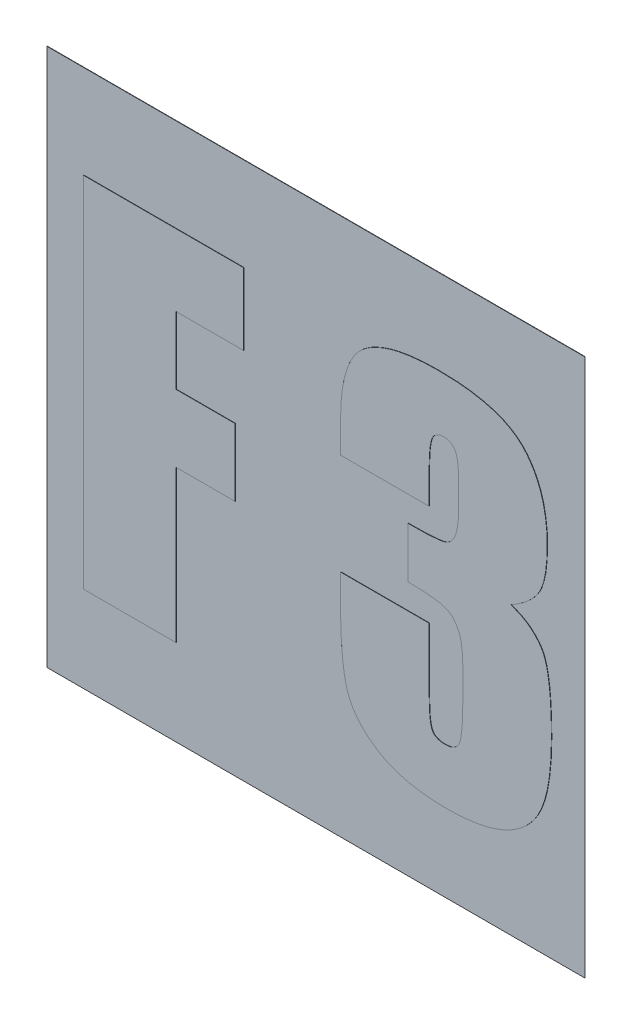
from build123d import *

# Parameters (mm, degrees)
SKETCH1_W           = 15
SKETCH1_H           = 15
BASE_EXTRUDE_DEPTH  = 0.01
BOSS_EXTRUDE1_DEPTH = 0.01


with BuildPart() as part:
    # Sketch1 → Base-Extrude (new body)
    with BuildSketch(Plane.XY):
        Rectangle(SKETCH1_W, SKETCH1_H)
    extrude(amount=BASE_EXTRUDE_DEPTH)

    # Sketch3 → Boss-Extrude1 (add)
    with BuildSketch(Plane.XY.offset(0.01)):
        Polygon((-6.472368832, 4.904808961), (-2.004055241, 4.904808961), (-2.004055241, 2.905826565), (-3.885450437, 2.905826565), (-3.885450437, 1.024431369), (-2.239229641, 1.024431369), (-2.239229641, -0.856963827), (-3.885450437, -0.856963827), (-3.885450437, -5.090103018), (-6.472368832, -5.090103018), align=None)
        with BuildLine():
            add(Edge.make_bspline(
                [(5.451708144, 0.49528897), (5.541704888, 0.46122907), (5.71609099, 0.395231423), (5.951267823, 0.254576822), (6.147281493, 0.079818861), (6.285825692, -0.092074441), (6.374221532, -0.261448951), (6.429491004, -0.425746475), (6.47634556, -0.625108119), (6.513333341, -0.861085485), (6.54456131, -1.13319291), (6.565545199, -1.441559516), (6.578417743, -1.785912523), (6.579330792, -2.027310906), (6.579810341, -2.154097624)],
                knots=[0, 0, 0, 0, 1.102876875, 2.137037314, 3.122829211, 4.104151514, 4.651126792, 5.306854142, 6.087576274, 6.999201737, 8.046202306, 9.229933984, 10.545112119, 12, 12, 12, 12], degree=3))
            add(Edge.make_bspline(
                [(6.579810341, -2.154097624), (6.579251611, -2.249649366), (6.578162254, -2.43594664), (6.565520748, -2.706880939), (6.542845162, -2.961695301), (6.514955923, -3.199828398), (6.475365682, -3.421508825), (6.4310113, -3.62688384), (6.375382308, -3.815865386), (6.311376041, -3.989219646), (6.237022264, -4.149908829), (6.151069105, -4.299319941), (6.050020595, -4.437378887), (5.940700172, -4.568709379), (5.816810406, -4.688656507), (5.679099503, -4.797101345), (5.531093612, -4.8981779), (5.370194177, -4.988868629), (5.196816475, -5.066913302), (5.012561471, -5.137635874), (4.815842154, -5.195751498), (4.60781307, -5.243417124), (4.388177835, -5.280292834), (4.156835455, -5.304852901), (3.913544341, -5.322479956), (3.747340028, -5.324329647), (3.662177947, -5.325277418)],
                knots=[0, 0, 0, 0, 1.369902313, 2.670899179, 3.88720887, 5.037313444, 6.107010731, 7.114651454, 8.048218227, 8.928962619, 9.761788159, 10.584085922, 11.395576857, 12.211804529, 13.031472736, 13.862491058, 14.72219323, 15.598945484, 16.506591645, 17.445921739, 18.426573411, 19.444718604, 20.504277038, 21.617454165, 22.779197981, 24, 24, 24, 24], degree=3))
            add(Edge.make_bspline(
                [(3.662177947, -5.325277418), (3.565978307, -5.324651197), (3.37886012, -5.323433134), (3.106134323, -5.30155964), (2.848949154, -5.271730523), (2.607716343, -5.227741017), (2.382277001, -5.171023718), (2.17313853, -5.100991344), (1.978289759, -5.021364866), (1.801922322, -4.924582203), (1.641206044, -4.819500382), (1.492410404, -4.711536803), (1.360037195, -4.595479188), (1.242042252, -4.47335357), (1.136273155, -4.347507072), (1.048139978, -4.21345763), (0.971968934, -4.075729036), (0.909481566, -3.928047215), (0.860011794, -3.763274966), (0.816012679, -3.57560507), (0.780160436, -3.360743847), (0.751608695, -3.119093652), (0.727605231, -2.851386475), (0.711525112, -2.556637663), (0.702857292, -2.23499193), (0.701274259, -2.011405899), (0.700450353, -1.895038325)],
                knots=[0, 0, 0, 0, 1.297206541, 2.523200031, 3.68822888, 4.788425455, 5.828288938, 6.820979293, 7.76145907, 8.663379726, 9.529520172, 10.350685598, 11.141021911, 11.900490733, 12.639834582, 13.354681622, 14.060787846, 14.760437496, 15.512955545, 16.378583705, 17.359134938, 18.449361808, 19.660232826, 20.984074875, 22.430331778, 24, 24, 24, 24], degree=3))
            Line((0.700450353, -1.895038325), (0.700450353, -1.092138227))
            Line((0.700450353, -1.092138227), (3.169781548, -1.092138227))
            Line((3.169781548, -1.092138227), (3.169781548, -2.765918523))
            add(Edge.make_bspline(
                [(3.169781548, -2.765918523), (3.17021198, -2.8192041), (3.171028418, -2.920275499), (3.175006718, -3.064808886), (3.179443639, -3.194167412), (3.189151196, -3.308058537), (3.199429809, -3.406909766), (3.213835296, -3.49033521), (3.230278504, -3.559125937), (3.252702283, -3.629681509), (3.299526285, -3.699935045), (3.383122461, -3.757103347), (3.489245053, -3.792340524), (3.568162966, -3.79513591), (3.610733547, -3.796643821)],
                knots=[0, 0, 0, 0, 1.493757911, 2.833340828, 4.053391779, 5.121294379, 6.037036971, 6.83864217, 7.492399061, 8.019055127, 8.909502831, 9.795636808, 10.810903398, 12, 12, 12, 12], degree=3))
            add(Edge.make_bspline(
                [(3.610733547, -3.796643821), (3.657620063, -3.794138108), (3.745079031, -3.789464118), (3.864542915, -3.747227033), (3.956695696, -3.672591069), (4.011087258, -3.586195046), (4.037803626, -3.496164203), (4.058275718, -3.405442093), (4.073156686, -3.291597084), (4.088363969, -3.155701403), (4.098765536, -2.996924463), (4.105963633, -2.815589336), (4.109019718, -2.611594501), (4.109976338, -2.468276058), (4.110479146, -2.392946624)],
                knots=[0, 0, 0, 0, 1.00518262, 1.875000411, 2.669993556, 3.509342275, 4.020974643, 4.681532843, 5.505591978, 6.484616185, 7.618559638, 8.921810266, 10.382076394, 12, 12, 12, 12], degree=3))
            Line((4.110479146, -2.392946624), (4.110479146, -1.691098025))
            add(Edge.make_bspline(
                [(4.110479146, -1.691098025), (4.109713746, -1.600362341), (4.108287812, -1.431322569), (4.08194848, -1.197917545), (4.044954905, -1.001849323), (3.985393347, -0.843187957), (3.909844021, -0.715148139), (3.819006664, -0.611594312), (3.710227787, -0.532893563), (3.6058627, -0.487905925), (3.510331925, -0.461725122), (3.422645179, -0.443464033), (3.319407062, -0.429706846), (3.201185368, -0.416713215), (3.067602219, -0.406017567), (2.918750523, -0.397065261), (2.755237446, -0.389185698), (2.641261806, -0.38749592), (2.581845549, -0.386615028)],
                knots=[0, 0, 0, 0, 1.795411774, 3.344836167, 4.645792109, 5.735849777, 6.682123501, 7.575395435, 8.44379141, 9.318010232, 9.809404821, 10.403985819, 11.089977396, 11.870716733, 12.758953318, 13.743088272, 14.823456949, 16, 16, 16, 16], degree=3))
            Line((2.581845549, -0.386615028), (2.581845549, 1.024431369))
            add(Edge.make_bspline(
                [(2.581845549, 1.024431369), (2.648600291, 1.025108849), (2.775373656, 1.026395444), (2.955465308, 1.02722335), (3.115410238, 1.032245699), (3.25494493, 1.042357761), (3.374484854, 1.05083456), (3.474597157, 1.061117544), (3.554479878, 1.075150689), (3.633822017, 1.096367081), (3.714735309, 1.136821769), (3.794334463, 1.206455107), (3.86083388, 1.295680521), (3.910135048, 1.408923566), (3.948380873, 1.548008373), (3.974310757, 1.718115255), (3.99035213, 1.920723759), (3.992004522, 2.066756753), (3.992891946, 2.145184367)],
                knots=[0, 0, 0, 0, 1.43856948, 2.731975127, 3.880825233, 4.885990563, 5.746351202, 6.463392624, 7.053595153, 7.492294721, 8.230047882, 8.978698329, 9.752066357, 10.608368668, 11.623534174, 12.853720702, 14.310277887, 16, 16, 16, 16], degree=3))
            Line((3.992891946, 2.145184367), (3.992891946, 2.722096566))
            add(Edge.make_bspline(
                [(3.992891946, 2.722096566), (3.992156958, 2.80480146), (3.990815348, 2.955766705), (3.974157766, 3.158867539), (3.944994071, 3.316687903), (3.902403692, 3.434210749), (3.840573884, 3.515071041), (3.769250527, 3.573837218), (3.680406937, 3.605166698), (3.617687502, 3.609231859), (3.585011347, 3.611349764)],
                knots=[0, 0, 0, 0, 1.803442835, 3.291911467, 4.43652086, 5.299582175, 5.986062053, 6.632668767, 7.287635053, 8, 8, 8, 8], degree=3))
            add(Edge.make_bspline(
                [(3.585011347, 3.611349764), (3.547813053, 3.610036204), (3.477965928, 3.607569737), (3.383466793, 3.567715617), (3.306078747, 3.507667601), (3.261348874, 3.435575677), (3.235519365, 3.364853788), (3.21734241, 3.297266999), (3.203718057, 3.215962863), (3.190130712, 3.121726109), (3.182222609, 3.013679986), (3.174137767, 2.892462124), (3.171289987, 2.757627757), (3.17030143, 2.663301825), (3.169781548, 2.613695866)],
                knots=[0, 0, 0, 0, 1.091565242, 2.049628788, 2.976927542, 3.946043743, 4.507512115, 5.201335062, 6.010901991, 6.942783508, 8.01465746, 9.211612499, 10.533588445, 12, 12, 12, 12], degree=3))
            Line((3.169781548, 2.613695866), (3.169781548, 1.729954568))
            Line((3.169781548, 1.729954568), (0.700450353, 1.729954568))
            Line((0.700450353, 1.729954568), (0.700450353, 2.613695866))
            add(Edge.make_bspline(
                [(0.700450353, 2.613695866), (0.702730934, 2.732564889), (0.707099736, 2.960276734), (0.735480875, 3.287167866), (0.786008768, 3.583612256), (0.857824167, 3.849811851), (0.946305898, 4.087948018), (1.059181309, 4.295504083), (1.191255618, 4.474908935), (1.348525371, 4.622731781), (1.526270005, 4.747928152), (1.728535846, 4.85095263), (1.951963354, 4.9418512), (2.20006964, 5.014787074), (2.47175811, 5.07095155), (2.767736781, 5.110214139), (3.086606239, 5.13714693), (3.30751876, 5.139018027), (3.421491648, 5.139983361)],
                knots=[0, 0, 0, 0, 1.312234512, 2.513786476, 3.61862398, 4.627262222, 5.553895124, 6.416137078, 7.227440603, 8.002142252, 8.788090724, 9.61970432, 10.50230122, 11.447758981, 12.470081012, 13.561996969, 14.74218878, 16, 16, 16, 16], degree=3))
            add(Edge.make_bspline(
                [(3.421491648, 5.139983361), (3.563633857, 5.137990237), (3.836088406, 5.134169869), (4.227351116, 5.10199337), (4.582669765, 5.044753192), (4.904044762, 4.970086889), (5.188966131, 4.869258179), (5.438231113, 4.746072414), (5.652827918, 4.600640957), (5.831971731, 4.430106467), (5.980716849, 4.239615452), (6.110987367, 4.034438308), (6.218830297, 3.810094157), (6.309654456, 3.569479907), (6.376396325, 3.310417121), (6.425663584, 3.035308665), (6.45834142, 2.742475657), (6.460905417, 2.540907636), (6.462223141, 2.437315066)],
                knots=[0, 0, 0, 0, 1.447304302, 2.774155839, 3.993188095, 5.109467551, 6.129268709, 7.063568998, 7.933660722, 8.758574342, 9.570850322, 10.389231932, 11.228749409, 12.100983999, 13.004041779, 13.948382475, 14.945604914, 16, 16, 16, 16], degree=3))
            add(Edge.make_bspline(
                [(6.462223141, 2.437315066), (6.461622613, 2.368090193), (6.46046325, 2.234446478), (6.448688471, 2.04145572), (6.43314227, 1.863552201), (6.409776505, 1.700127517), (6.376800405, 1.552361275), (6.337572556, 1.418832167), (6.295732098, 1.298595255), (6.22169852, 1.159141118), (6.106697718, 0.995839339), (5.92607923, 0.81879231), (5.707966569, 0.645416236), (5.540092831, 0.547068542), (5.451708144, 0.49528897)],
                knots=[0, 0, 0, 0, 1.06493662, 2.055938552, 2.973870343, 3.81207079, 4.593931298, 5.300636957, 5.953531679, 6.5477624, 7.724209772, 9.010163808, 10.425866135, 12, 12, 12, 12], degree=3))
        make_face()
    extrude(amount=BOSS_EXTRUDE1_DEPTH)


solid = part.part
